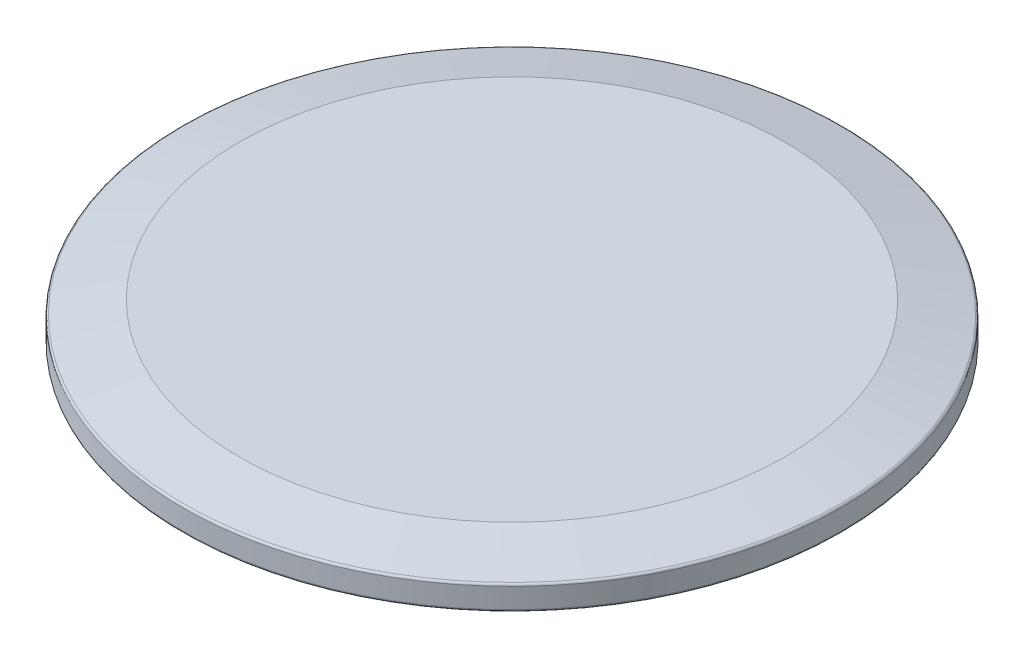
from build123d import *

# Parameters (mm, degrees)
FILLET_1_R = 0.3
FILLET_2_R = 0.3
FILLET_3_R = 0.3


with BuildPart() as part:
    # Sketch 1 → Revolve 1 (revolve)
    with BuildSketch(Plane.XY):
        Polygon((-35.25, 2.5), (-31.75, 2.5), (-31.75, 0), (0, 0), (0, 5), (-36, 5), (-43.5, 3.2), (-43.5, 0), (-35.25, 0), align=None)
    revolve(axis=Axis((0, 5, 0), (0, -1, 0)))

    # Fillet 1
    fillet_1_edges = [part.edges().sort_by_distance(p)[0] for p in [
        (43.5, 3.2, 0),
    ]]
    fillet(fillet_1_edges, radius=FILLET_1_R)

    # Fillet 2
    fillet_2_edges = [part.edges().sort_by_distance(p)[0] for p in [
        (43.5, 0, 0),
    ]]
    fillet(fillet_2_edges, radius=FILLET_2_R)

    # Fillet 3
    fillet_3_edges = [part.edges().sort_by_distance(p)[0] for p in [
        (35.25, 0, 0),
    ]]
    fillet(fillet_3_edges, radius=FILLET_3_R)


solid = part.part
